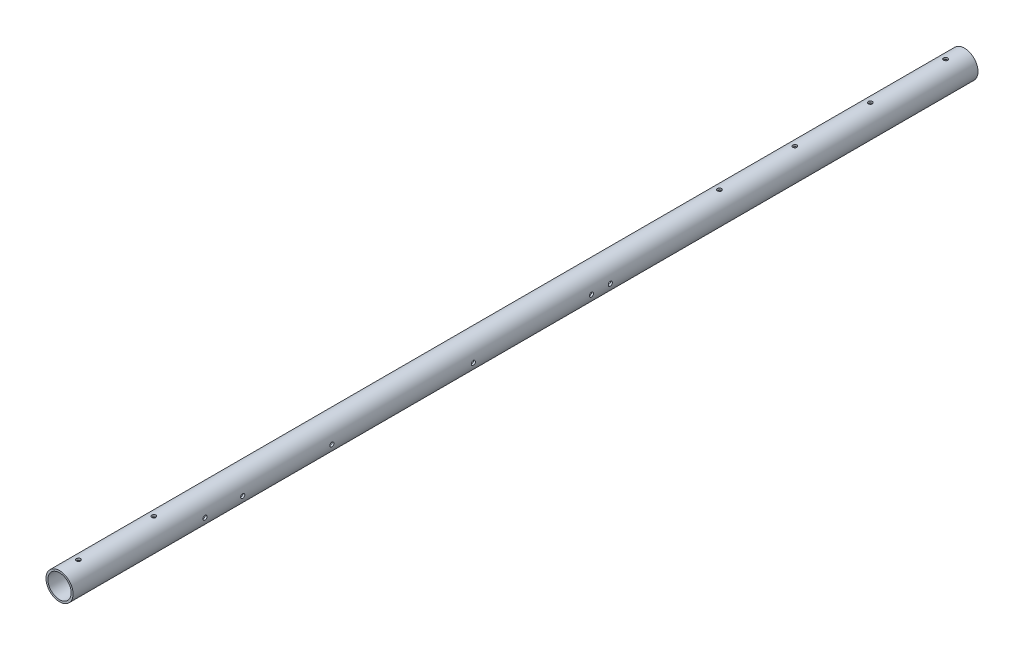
from build123d import *

# Parameters (mm, degrees)
SKETCH1_R          = 36.5125
SKETCH1_R_2        = 31.369
EXTRUDE1_DEPTH     = 1219.2
SKETCH3_R          = 5.588
CUT_EXTRUDE2_DEPTH = 1222.934421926
LPATTERN2_COUNT    = 4
LPATTERN2_PITCH    = 203.2
SKETCH4_R          = 5.588
CUT_EXTRUDE3_DEPTH = 1222.934422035
LPATTERN3_COUNT    = 2
LPATTERN3_PITCH    = 203.2
SKETCH5_R          = 5.588
CUT_EXTRUDE4_DEPTH = 1222.934422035
LPATTERN4_COUNT    = 2
LPATTERN4_PITCH    = 101.6
SKETCH6_R          = 5.588
CUT_EXTRUDE5_DEPTH = 1222.934422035
LPATTERN5_COUNT    = 2
LPATTERN5_PITCH    = 50.8
SKETCH7_R          = 5.588
CUT_EXTRUDE6_DEPTH = 1222.934422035


with BuildPart() as part:
    # Sketch1 → Extrude1 (new, symmetric)
    with BuildSketch(Plane.XY):
        with Locations(Location((0, 0, 0), (0, 0, 180))):
            Circle(SKETCH1_R)
        with Locations(Location((0, 0, 0), (0, 0, 180))):
            Circle(SKETCH1_R_2, mode=Mode.SUBTRACT)
    extrude(amount=EXTRUDE1_DEPTH, both=True)

    # Sketch3 → Cut-Extrude2 (cut, through all)
    with BuildSketch(Plane(origin=(0, 36.576, 0), x_dir=(-1, 0, 0), z_dir=(0, 1, 0))):
        with Locations(Location((0, -1168.4, 0), (0, 0, 90))):
            Circle(SKETCH3_R)
    cut_extrude2 = extrude(amount=-CUT_EXTRUDE2_DEPTH, mode=Mode.SUBTRACT)

    # LPattern2: Cut-Extrude2 ×4
    with Locations(*[(0, 0, i * LPATTERN2_PITCH) for i in range(1, LPATTERN2_COUNT)]):
        add(cut_extrude2, mode=Mode.SUBTRACT)

    # Sketch4 → Cut-Extrude3 (cut, through all)
    with BuildSketch(Plane(origin=(0, 36.576, 0), x_dir=(-1, 0, 0), z_dir=(0, 1, 0))):
        with Locations(Location((0, 1168.4, 0), (0, 0, 90))):
            Circle(SKETCH4_R)
    cut_extrude3 = extrude(amount=-CUT_EXTRUDE3_DEPTH, mode=Mode.SUBTRACT)

    # LPattern3: Cut-Extrude3 ×2
    with Locations(*[(0, 0, -i * LPATTERN3_PITCH) for i in range(1, LPATTERN3_COUNT)]):
        add(cut_extrude3, mode=Mode.SUBTRACT)

    # Sketch5 → Cut-Extrude4 (cut, through all)
    with BuildSketch(Plane(origin=(36.576, 0, 0), x_dir=(0, 0, -1), z_dir=(1, 0, 0))):
        with Locations((-863.6, 0)):
            Circle(SKETCH5_R)
    cut_extrude4 = extrude(amount=-CUT_EXTRUDE4_DEPTH, mode=Mode.SUBTRACT)

    # LPattern4: Cut-Extrude4 ×2
    with Locations(*[(0, 0, -i * LPATTERN4_PITCH) for i in range(1, LPATTERN4_COUNT)]):
        add(cut_extrude4, mode=Mode.SUBTRACT)

    # Sketch6 → Cut-Extrude5 (cut, through all)
    with BuildSketch(Plane(origin=(36.576, 0, 0), x_dir=(0, 0, -1), z_dir=(1, 0, 0))):
        with Locations((177.8, 0)):
            Circle(SKETCH6_R)
    cut_extrude5 = extrude(amount=-CUT_EXTRUDE5_DEPTH, mode=Mode.SUBTRACT)

    # LPattern5: Cut-Extrude5 ×2
    with Locations(*[(0, 0, -i * LPATTERN5_PITCH) for i in range(1, LPATTERN5_COUNT)]):
        add(cut_extrude5, mode=Mode.SUBTRACT)

    # Sketch7 → Cut-Extrude6 (cut, through all)
    with BuildSketch(Plane(origin=(36.576, 0, 0), x_dir=(0, 0, -1), z_dir=(1, 0, 0))):
        with Locations((-521.462, 0)):
            Circle(SKETCH7_R)
        with Locations((-140.462, 0)):
            Circle(SKETCH7_R)
    extrude(amount=-CUT_EXTRUDE6_DEPTH, mode=Mode.SUBTRACT)


solid = part.part
